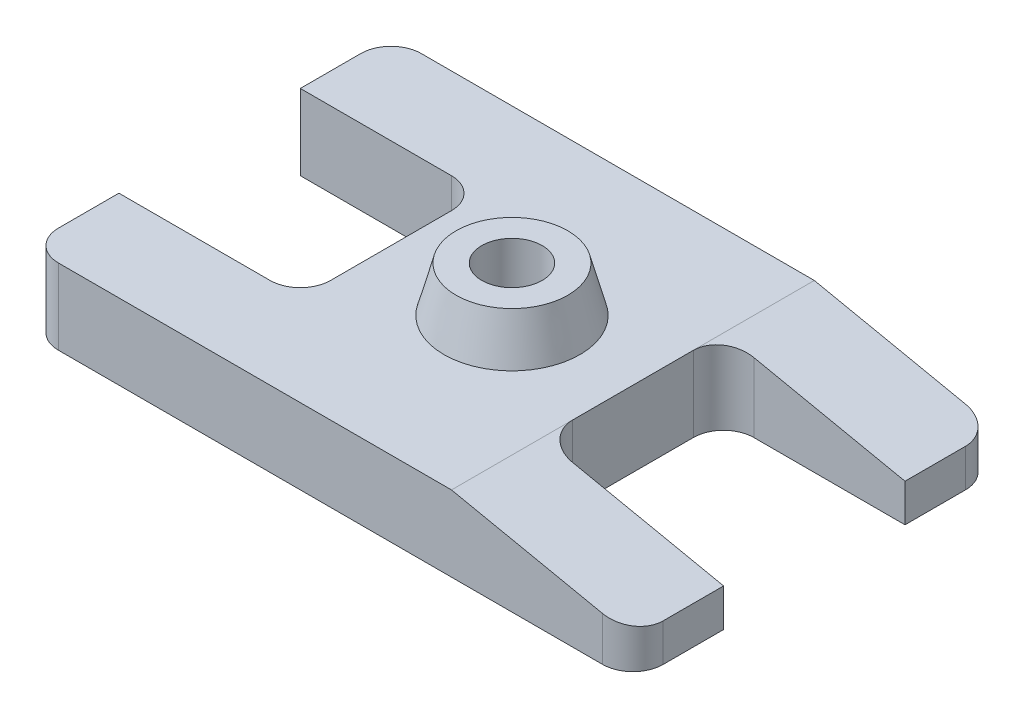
ISO-10303-21;
HEADER;
FILE_DESCRIPTION(('STEP AP214'),'2;1');
FILE_NAME('part.step','',(''),(''),'','','');
FILE_SCHEMA(('AUTOMOTIVE_DESIGN { 1 0 10303 214 1 1 1 1 }'));
ENDSEC;
DATA;
#1=APPLICATION_CONTEXT('core data for automotive mechanical design processes');
#2=APPLICATION_PROTOCOL_DEFINITION('international standard','automotive_design',2000,#1);
#3=PRODUCT_CONTEXT('',#1,'mechanical');
#4=PRODUCT('Part','Part','',(#3));
#5=PRODUCT_RELATED_PRODUCT_CATEGORY('part','',(#4));
#6=PRODUCT_DEFINITION_FORMATION('','',#4);
#7=PRODUCT_DEFINITION_CONTEXT('part definition',#1,'design');
#8=PRODUCT_DEFINITION('design','',#6,#7);
#9=PRODUCT_DEFINITION_SHAPE('','',#8);
#10=(LENGTH_UNIT() NAMED_UNIT(*) SI_UNIT(.MILLI.,.METRE.));
#11=(NAMED_UNIT(*) PLANE_ANGLE_UNIT() SI_UNIT($,.RADIAN.));
#12=(NAMED_UNIT(*) SI_UNIT($,.STERADIAN.) SOLID_ANGLE_UNIT());
#13=UNCERTAINTY_MEASURE_WITH_UNIT(LENGTH_MEASURE(1.E-05),#10,'distance_accuracy_value','');
#14=(GEOMETRIC_REPRESENTATION_CONTEXT(3) GLOBAL_UNCERTAINTY_ASSIGNED_CONTEXT((#13)) GLOBAL_UNIT_ASSIGNED_CONTEXT((#10,
#11,#12)) REPRESENTATION_CONTEXT('',''));
#15=CARTESIAN_POINT('',(0.,0.,0.));
#16=DIRECTION('',(0.,0.,1.));
#17=DIRECTION('',(1.,0.,0.));
#18=AXIS2_PLACEMENT_3D('',#15,#16,#17);
#19=CARTESIAN_POINT('',(100.,25.,60.));
#20=DIRECTION('',(-1.,0.,0.));
#21=DIRECTION('',(0.,0.,1.));
#22=AXIS2_PLACEMENT_3D('',#19,#20,#21);
#23=PLANE('',#22);
#24=DIRECTION('',(0.,0.,-1.));
#25=VECTOR('',#24,1.);
#26=CARTESIAN_POINT('',(100.,0.,60.));
#27=LINE('',#26,#25);
#28=CARTESIAN_POINT('',(100.,0.,-30.));
#29=VERTEX_POINT('',#28);
#30=CARTESIAN_POINT('',(100.,0.,-50.));
#31=VERTEX_POINT('',#30);
#32=EDGE_CURVE('E261',#29,#31,#27,.T.);
#33=ORIENTED_EDGE('',*,*,#32,.T.);
#34=DIRECTION('',(0.,-1.,0.));
#35=VECTOR('',#34,1.);
#36=CARTESIAN_POINT('',(100.,25.,-50.));
#37=LINE('',#36,#35);
#38=CARTESIAN_POINT('',(100.,12.5,-50.));
#39=VERTEX_POINT('',#38);
#40=EDGE_CURVE('E320',#31,#39,#37,.F.);
#41=ORIENTED_EDGE('',*,*,#40,.T.);
#42=DIRECTION('',(0.,0.,-1.));
#43=VECTOR('',#42,1.);
#44=CARTESIAN_POINT('',(100.,12.5,503.217602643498));
#45=LINE('',#44,#43);
#46=CARTESIAN_POINT('',(100.,12.5,-30.));
#47=VERTEX_POINT('',#46);
#48=EDGE_CURVE('E257',#47,#39,#45,.T.);
#49=ORIENTED_EDGE('',*,*,#48,.F.);
#50=DIRECTION('',(0.,-1.,0.));
#51=VECTOR('',#50,1.);
#52=CARTESIAN_POINT('',(100.,40.,-30.));
#53=LINE('',#52,#51);
#54=EDGE_CURVE('E226',#47,#29,#53,.T.);
#55=ORIENTED_EDGE('',*,*,#54,.T.);
#56=EDGE_LOOP('',(#33,#41,#49,#55));
#57=FACE_BOUND('',#56,.T.);
#58=ADVANCED_FACE('F41',(#57),#23,.F.);
#59=CARTESIAN_POINT('',(100.,12.5,50.));
#60=VERTEX_POINT('',#59);
#61=CARTESIAN_POINT('',(100.,12.5,30.));
#62=VERTEX_POINT('',#61);
#63=EDGE_CURVE('E253',#60,#62,#45,.T.);
#64=ORIENTED_EDGE('',*,*,#63,.F.);
#65=DIRECTION('',(0.,-1.,0.));
#66=VECTOR('',#65,1.);
#67=CARTESIAN_POINT('',(100.,25.,50.));
#68=LINE('',#67,#66);
#69=CARTESIAN_POINT('',(100.,0.,50.));
#70=VERTEX_POINT('',#69);
#71=EDGE_CURVE('E295',#60,#70,#68,.T.);
#72=ORIENTED_EDGE('',*,*,#71,.T.);
#73=CARTESIAN_POINT('',(100.,0.,30.));
#74=VERTEX_POINT('',#73);
#75=EDGE_CURVE('E269',#70,#74,#27,.T.);
#76=ORIENTED_EDGE('',*,*,#75,.T.);
#77=DIRECTION('',(0.,-1.,0.));
#78=VECTOR('',#77,1.);
#79=CARTESIAN_POINT('',(100.,40.,30.));
#80=LINE('',#79,#78);
#81=EDGE_CURVE('E229',#62,#74,#80,.T.);
#82=ORIENTED_EDGE('',*,*,#81,.F.);
#83=EDGE_LOOP('',(#64,#72,#76,#82));
#84=FACE_BOUND('',#83,.T.);
#85=ADVANCED_FACE('F355',(#84),#23,.F.);
#86=CARTESIAN_POINT('',(-100.,25.,60.));
#87=DIRECTION('',(1.,0.,0.));
#88=DIRECTION('',(0.,0.,-1.));
#89=AXIS2_PLACEMENT_3D('',#86,#87,#88);
#90=PLANE('',#89);
#91=DIRECTION('',(0.,0.,1.));
#92=VECTOR('',#91,1.);
#93=CARTESIAN_POINT('',(-100.,0.,60.));
#94=LINE('',#93,#92);
#95=CARTESIAN_POINT('',(-100.,0.,30.));
#96=VERTEX_POINT('',#95);
#97=CARTESIAN_POINT('',(-100.,0.,50.));
#98=VERTEX_POINT('',#97);
#99=EDGE_CURVE('E275',#96,#98,#94,.T.);
#100=ORIENTED_EDGE('',*,*,#99,.T.);
#101=DIRECTION('',(0.,-1.,0.));
#102=VECTOR('',#101,1.);
#103=CARTESIAN_POINT('',(-100.,25.,50.));
#104=LINE('',#103,#102);
#105=CARTESIAN_POINT('',(-100.,25.,50.));
#106=VERTEX_POINT('',#105);
#107=EDGE_CURVE('E193',#98,#106,#104,.F.);
#108=ORIENTED_EDGE('',*,*,#107,.T.);
#109=DIRECTION('',(0.,0.,1.));
#110=VECTOR('',#109,1.);
#111=CARTESIAN_POINT('',(-100.,25.,60.));
#112=LINE('',#111,#110);
#113=CARTESIAN_POINT('',(-100.,25.,30.));
#114=VERTEX_POINT('',#113);
#115=EDGE_CURVE('E264',#114,#106,#112,.T.);
#116=ORIENTED_EDGE('',*,*,#115,.F.);
#117=DIRECTION('',(0.,-1.,0.));
#118=VECTOR('',#117,1.);
#119=CARTESIAN_POINT('',(-100.,40.,30.));
#120=LINE('',#119,#118);
#121=EDGE_CURVE('E181',#114,#96,#120,.T.);
#122=ORIENTED_EDGE('',*,*,#121,.T.);
#123=EDGE_LOOP('',(#100,#108,#116,#122));
#124=FACE_BOUND('',#123,.T.);
#125=ADVANCED_FACE('F335',(#124),#90,.F.);
#126=CARTESIAN_POINT('',(-100.,25.,-50.));
#127=VERTEX_POINT('',#126);
#128=CARTESIAN_POINT('',(-100.,25.,-30.));
#129=VERTEX_POINT('',#128);
#130=EDGE_CURVE('E178',#127,#129,#112,.T.);
#131=ORIENTED_EDGE('',*,*,#130,.F.);
#132=DIRECTION('',(0.,-1.,0.));
#133=VECTOR('',#132,1.);
#134=CARTESIAN_POINT('',(-100.,25.,-50.));
#135=LINE('',#134,#133);
#136=CARTESIAN_POINT('',(-100.,0.,-50.));
#137=VERTEX_POINT('',#136);
#138=EDGE_CURVE('E324',#127,#137,#135,.T.);
#139=ORIENTED_EDGE('',*,*,#138,.T.);
#140=CARTESIAN_POINT('',(-100.,0.,-30.));
#141=VERTEX_POINT('',#140);
#142=EDGE_CURVE('E276',#137,#141,#94,.T.);
#143=ORIENTED_EDGE('',*,*,#142,.T.);
#144=DIRECTION('',(0.,-1.,0.));
#145=VECTOR('',#144,1.);
#146=CARTESIAN_POINT('',(-100.,40.,-30.));
#147=LINE('',#146,#145);
#148=EDGE_CURVE('E217',#129,#141,#147,.T.);
#149=ORIENTED_EDGE('',*,*,#148,.F.);
#150=EDGE_LOOP('',(#131,#139,#143,#149));
#151=FACE_BOUND('',#150,.T.);
#152=ADVANCED_FACE('F410',(#151),#90,.F.);
#153=CARTESIAN_POINT('',(0.,25.,0.));
#154=DIRECTION('',(0.,-1.,0.));
#155=DIRECTION('',(0.,0.,-1.));
#156=AXIS2_PLACEMENT_3D('',#153,#154,#155);
#157=PLANE('',#156);
#158=CARTESIAN_POINT('',(0.,25.,0.));
#159=DIRECTION('',(0.,1.,0.));
#160=DIRECTION('',(0.,0.,1.));
#161=AXIS2_PLACEMENT_3D('',#158,#159,#160);
#162=CIRCLE('',#161,22.5);
#163=CARTESIAN_POINT('',(0.,25.,22.5));
#164=VERTEX_POINT('',#163);
#165=EDGE_CURVE('E246',#164,#164,#162,.T.);
#166=ORIENTED_EDGE('',*,*,#165,.F.);
#167=EDGE_LOOP('',(#166));
#168=FACE_BOUND('',#167,.T.);
#169=DIRECTION('',(-1.,0.,0.));
#170=VECTOR('',#169,1.);
#171=CARTESIAN_POINT('',(-100.,25.,-60.));
#172=LINE('',#171,#170);
#173=CARTESIAN_POINT('',(40.,25.,-60.));
#174=VERTEX_POINT('',#173);
#175=CARTESIAN_POINT('',(-90.,25.,-60.));
#176=VERTEX_POINT('',#175);
#177=EDGE_CURVE('E262',#174,#176,#172,.T.);
#178=ORIENTED_EDGE('',*,*,#177,.T.);
#179=CARTESIAN_POINT('',(-90.,25.,-50.));
#180=DIRECTION('',(0.,-1.,0.));
#181=DIRECTION('',(0.,0.,-1.));
#182=AXIS2_PLACEMENT_3D('',#179,#180,#181);
#183=CIRCLE('',#182,10.);
#184=EDGE_CURVE('E329',#176,#127,#183,.F.);
#185=ORIENTED_EDGE('',*,*,#184,.T.);
#186=ORIENTED_EDGE('',*,*,#130,.T.);
#187=DIRECTION('',(-1.,0.,0.));
#188=VECTOR('',#187,1.);
#189=CARTESIAN_POINT('',(0.,25.,-30.));
#190=LINE('',#189,#188);
#191=CARTESIAN_POINT('',(-50.,25.,-30.));
#192=VERTEX_POINT('',#191);
#193=EDGE_CURVE('E167',#192,#129,#190,.T.);
#194=ORIENTED_EDGE('',*,*,#193,.F.);
#195=CARTESIAN_POINT('',(-50.,25.,-20.));
#196=DIRECTION('',(0.,-1.,0.));
#197=DIRECTION('',(0.,0.,-1.));
#198=AXIS2_PLACEMENT_3D('',#195,#196,#197);
#199=CIRCLE('',#198,10.);
#200=CARTESIAN_POINT('',(-40.,25.,-20.));
#201=VERTEX_POINT('',#200);
#202=EDGE_CURVE('E12',#192,#201,#199,.T.);
#203=ORIENTED_EDGE('',*,*,#202,.T.);
#204=DIRECTION('',(0.,0.,-1.));
#205=VECTOR('',#204,1.);
#206=CARTESIAN_POINT('',(-40.,25.,0.));
#207=LINE('',#206,#205);
#208=CARTESIAN_POINT('',(-40.,25.,20.));
#209=VERTEX_POINT('',#208);
#210=EDGE_CURVE('E180',#209,#201,#207,.T.);
#211=ORIENTED_EDGE('',*,*,#210,.F.);
#212=CARTESIAN_POINT('',(-50.,25.,20.));
#213=DIRECTION('',(0.,-1.,0.));
#214=DIRECTION('',(0.,0.,-1.));
#215=AXIS2_PLACEMENT_3D('',#212,#213,#214);
#216=CIRCLE('',#215,10.);
#217=CARTESIAN_POINT('',(-50.,25.,30.));
#218=VERTEX_POINT('',#217);
#219=EDGE_CURVE('E206',#209,#218,#216,.T.);
#220=ORIENTED_EDGE('',*,*,#219,.T.);
#221=DIRECTION('',(1.,0.,0.));
#222=VECTOR('',#221,1.);
#223=CARTESIAN_POINT('',(0.,25.,30.));
#224=LINE('',#223,#222);
#225=EDGE_CURVE('E242',#114,#218,#224,.T.);
#226=ORIENTED_EDGE('',*,*,#225,.F.);
#227=ORIENTED_EDGE('',*,*,#115,.T.);
#228=CARTESIAN_POINT('',(-90.,25.,50.));
#229=DIRECTION('',(0.,-1.,0.));
#230=DIRECTION('',(0.,0.,-1.));
#231=AXIS2_PLACEMENT_3D('',#228,#229,#230);
#232=CIRCLE('',#231,10.);
#233=CARTESIAN_POINT('',(-90.,25.,60.));
#234=VERTEX_POINT('',#233);
#235=EDGE_CURVE('E327',#106,#234,#232,.F.);
#236=ORIENTED_EDGE('',*,*,#235,.T.);
#237=DIRECTION('',(1.,0.,0.));
#238=VECTOR('',#237,1.);
#239=CARTESIAN_POINT('',(-100.,25.,60.));
#240=LINE('',#239,#238);
#241=CARTESIAN_POINT('',(40.,25.,60.));
#242=VERTEX_POINT('',#241);
#243=EDGE_CURVE('E267',#234,#242,#240,.T.);
#244=ORIENTED_EDGE('',*,*,#243,.T.);
#245=DIRECTION('',(0.,0.,-1.));
#246=VECTOR('',#245,1.);
#247=CARTESIAN_POINT('',(40.,25.,503.217602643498));
#248=LINE('',#247,#246);
#249=CARTESIAN_POINT('',(40.,25.,20.));
#250=VERTEX_POINT('',#249);
#251=EDGE_CURVE('E56',#242,#250,#248,.T.);
#252=ORIENTED_EDGE('',*,*,#251,.T.);
#253=CARTESIAN_POINT('',(40.,25.,-20.));
#254=VERTEX_POINT('',#253);
#255=EDGE_CURVE('E259',#250,#254,#248,.T.);
#256=ORIENTED_EDGE('',*,*,#255,.T.);
#257=EDGE_CURVE('E76',#254,#174,#248,.T.);
#258=ORIENTED_EDGE('',*,*,#257,.T.);
#259=EDGE_LOOP('',(#178,#185,#186,#194,#203,#211,#220,#226,#227,#236,#244,#252,#256,#258));
#260=FACE_BOUND('',#259,.T.);
#261=ADVANCED_FACE('F176',(#168,#260),#157,.F.);
#262=CARTESIAN_POINT('',(0.,0.,0.));
#263=DIRECTION('',(0.,-1.,0.));
#264=DIRECTION('',(0.,0.,-1.));
#265=AXIS2_PLACEMENT_3D('',#262,#263,#264);
#266=PLANE('',#265);
#267=CARTESIAN_POINT('',(0.,0.,0.));
#268=DIRECTION('',(0.,1.,0.));
#269=DIRECTION('',(0.,0.,1.));
#270=AXIS2_PLACEMENT_3D('',#267,#268,#269);
#271=CIRCLE('',#270,10.);
#272=CARTESIAN_POINT('',(0.,0.,10.));
#273=VERTEX_POINT('',#272);
#274=EDGE_CURVE('E683',#273,#273,#271,.T.);
#275=ORIENTED_EDGE('',*,*,#274,.T.);
#276=EDGE_LOOP('',(#275));
#277=FACE_BOUND('',#276,.T.);
#278=ORIENTED_EDGE('',*,*,#75,.F.);
#279=CARTESIAN_POINT('',(90.,0.,50.));
#280=DIRECTION('',(0.,-1.,0.));
#281=DIRECTION('',(0.,0.,-1.));
#282=AXIS2_PLACEMENT_3D('',#279,#280,#281);
#283=CIRCLE('',#282,10.);
#284=CARTESIAN_POINT('',(90.,0.,60.));
#285=VERTEX_POINT('',#284);
#286=EDGE_CURVE('E304',#70,#285,#283,.T.);
#287=ORIENTED_EDGE('',*,*,#286,.T.);
#288=DIRECTION('',(1.,0.,0.));
#289=VECTOR('',#288,1.);
#290=CARTESIAN_POINT('',(-100.,0.,60.));
#291=LINE('',#290,#289);
#292=CARTESIAN_POINT('',(-90.,0.,60.));
#293=VERTEX_POINT('',#292);
#294=EDGE_CURVE('E265',#293,#285,#291,.T.);
#295=ORIENTED_EDGE('',*,*,#294,.F.);
#296=CARTESIAN_POINT('',(-90.,0.,50.));
#297=DIRECTION('',(0.,-1.,0.));
#298=DIRECTION('',(0.,0.,-1.));
#299=AXIS2_PLACEMENT_3D('',#296,#297,#298);
#300=CIRCLE('',#299,10.);
#301=EDGE_CURVE('E298',#293,#98,#300,.T.);
#302=ORIENTED_EDGE('',*,*,#301,.T.);
#303=ORIENTED_EDGE('',*,*,#99,.F.);
#304=DIRECTION('',(1.,0.,0.));
#305=VECTOR('',#304,1.);
#306=CARTESIAN_POINT('',(-100.,0.,30.));
#307=LINE('',#306,#305);
#308=CARTESIAN_POINT('',(-50.,0.,30.));
#309=VERTEX_POINT('',#308);
#310=EDGE_CURVE('E215',#96,#309,#307,.T.);
#311=ORIENTED_EDGE('',*,*,#310,.T.);
#312=CARTESIAN_POINT('',(-50.,0.,20.));
#313=DIRECTION('',(0.,-1.,0.));
#314=DIRECTION('',(0.,0.,-1.));
#315=AXIS2_PLACEMENT_3D('',#312,#313,#314);
#316=CIRCLE('',#315,10.);
#317=CARTESIAN_POINT('',(-40.,0.,20.));
#318=VERTEX_POINT('',#317);
#319=EDGE_CURVE('E204',#309,#318,#316,.F.);
#320=ORIENTED_EDGE('',*,*,#319,.T.);
#321=DIRECTION('',(0.,0.,-1.));
#322=VECTOR('',#321,1.);
#323=CARTESIAN_POINT('',(-40.,0.,-30.));
#324=LINE('',#323,#322);
#325=CARTESIAN_POINT('',(-40.,0.,-20.));
#326=VERTEX_POINT('',#325);
#327=EDGE_CURVE('E212',#318,#326,#324,.T.);
#328=ORIENTED_EDGE('',*,*,#327,.T.);
#329=CARTESIAN_POINT('',(-50.,0.,-20.));
#330=DIRECTION('',(0.,-1.,0.));
#331=DIRECTION('',(0.,0.,-1.));
#332=AXIS2_PLACEMENT_3D('',#329,#330,#331);
#333=CIRCLE('',#332,10.);
#334=CARTESIAN_POINT('',(-50.,0.,-30.));
#335=VERTEX_POINT('',#334);
#336=EDGE_CURVE('E49',#326,#335,#333,.F.);
#337=ORIENTED_EDGE('',*,*,#336,.T.);
#338=DIRECTION('',(-1.,0.,0.));
#339=VECTOR('',#338,1.);
#340=CARTESIAN_POINT('',(-100.,0.,-30.));
#341=LINE('',#340,#339);
#342=EDGE_CURVE('E170',#335,#141,#341,.T.);
#343=ORIENTED_EDGE('',*,*,#342,.T.);
#344=ORIENTED_EDGE('',*,*,#142,.F.);
#345=CARTESIAN_POINT('',(-90.,0.,-50.));
#346=DIRECTION('',(0.,-1.,0.));
#347=DIRECTION('',(0.,0.,-1.));
#348=AXIS2_PLACEMENT_3D('',#345,#346,#347);
#349=CIRCLE('',#348,10.);
#350=CARTESIAN_POINT('',(-90.,0.,-60.));
#351=VERTEX_POINT('',#350);
#352=EDGE_CURVE('E300',#137,#351,#349,.T.);
#353=ORIENTED_EDGE('',*,*,#352,.T.);
#354=DIRECTION('',(-1.,0.,0.));
#355=VECTOR('',#354,1.);
#356=CARTESIAN_POINT('',(-100.,0.,-60.));
#357=LINE('',#356,#355);
#358=CARTESIAN_POINT('',(90.,0.,-60.));
#359=VERTEX_POINT('',#358);
#360=EDGE_CURVE('E272',#359,#351,#357,.T.);
#361=ORIENTED_EDGE('',*,*,#360,.F.);
#362=CARTESIAN_POINT('',(90.,0.,-50.));
#363=DIRECTION('',(0.,-1.,0.));
#364=DIRECTION('',(0.,0.,-1.));
#365=AXIS2_PLACEMENT_3D('',#362,#363,#364);
#366=CIRCLE('',#365,10.);
#367=EDGE_CURVE('E302',#359,#31,#366,.T.);
#368=ORIENTED_EDGE('',*,*,#367,.T.);
#369=ORIENTED_EDGE('',*,*,#32,.F.);
#370=DIRECTION('',(-1.,0.,0.));
#371=VECTOR('',#370,1.);
#372=CARTESIAN_POINT('',(100.,0.,-30.));
#373=LINE('',#372,#371);
#374=CARTESIAN_POINT('',(50.,0.,-30.));
#375=VERTEX_POINT('',#374);
#376=EDGE_CURVE('E219',#29,#375,#373,.T.);
#377=ORIENTED_EDGE('',*,*,#376,.T.);
#378=CARTESIAN_POINT('',(50.,0.,-20.));
#379=DIRECTION('',(0.,-1.,0.));
#380=DIRECTION('',(0.,0.,-1.));
#381=AXIS2_PLACEMENT_3D('',#378,#379,#380);
#382=CIRCLE('',#381,10.);
#383=CARTESIAN_POINT('',(40.,0.,-20.));
#384=VERTEX_POINT('',#383);
#385=EDGE_CURVE('E172',#375,#384,#382,.F.);
#386=ORIENTED_EDGE('',*,*,#385,.T.);
#387=DIRECTION('',(0.,0.,1.));
#388=VECTOR('',#387,1.);
#389=CARTESIAN_POINT('',(40.,0.,-30.));
#390=LINE('',#389,#388);
#391=CARTESIAN_POINT('',(40.,0.,20.));
#392=VERTEX_POINT('',#391);
#393=EDGE_CURVE('E236',#384,#392,#390,.T.);
#394=ORIENTED_EDGE('',*,*,#393,.T.);
#395=CARTESIAN_POINT('',(50.,0.,20.));
#396=DIRECTION('',(0.,-1.,0.));
#397=DIRECTION('',(0.,0.,-1.));
#398=AXIS2_PLACEMENT_3D('',#395,#396,#397);
#399=CIRCLE('',#398,10.);
#400=CARTESIAN_POINT('',(50.,0.,30.));
#401=VERTEX_POINT('',#400);
#402=EDGE_CURVE('E88',#392,#401,#399,.F.);
#403=ORIENTED_EDGE('',*,*,#402,.T.);
#404=DIRECTION('',(1.,0.,0.));
#405=VECTOR('',#404,1.);
#406=CARTESIAN_POINT('',(100.,0.,30.));
#407=LINE('',#406,#405);
#408=EDGE_CURVE('E233',#401,#74,#407,.T.);
#409=ORIENTED_EDGE('',*,*,#408,.T.);
#410=EDGE_LOOP('',(#278,#287,#295,#302,#303,#311,#320,#328,#337,#343,#344,#353,#361,#368,#369,
#377,#386,#394,#403,#409));
#411=FACE_BOUND('',#410,.T.);
#412=ADVANCED_FACE('F209',(#277,#411),#266,.T.);
#413=CARTESIAN_POINT('',(40.,25.,503.217602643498));
#414=DIRECTION('',(0.203954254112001,0.978980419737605,0.));
#415=DIRECTION('',(-0.978980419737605,0.203954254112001,0.));
#416=AXIS2_PLACEMENT_3D('',#413,#414,#415);
#417=PLANE('',#416);
#418=ORIENTED_EDGE('',*,*,#48,.T.);
#419=CARTESIAN_POINT('',(90.,14.5833333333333,-50.));
#420=DIRECTION('',(0.203954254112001,0.978980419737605,0.));
#421=DIRECTION('',(0.978980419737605,-0.203954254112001,0.));
#422=AXIS2_PLACEMENT_3D('',#419,#420,#421);
#423=ELLIPSE('',#422,10.2147088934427,10.);
#424=CARTESIAN_POINT('',(90.,14.5833333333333,-60.));
#425=VERTEX_POINT('',#424);
#426=EDGE_CURVE('E322',#39,#425,#423,.T.);
#427=ORIENTED_EDGE('',*,*,#426,.T.);
#428=DIRECTION('',(-0.978980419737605,0.203954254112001,0.));
#429=VECTOR('',#428,1.);
#430=CARTESIAN_POINT('',(-94.1763727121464,52.9534109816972,-60.));
#431=LINE('',#430,#429);
#432=EDGE_CURVE('E256',#425,#174,#431,.T.);
#433=ORIENTED_EDGE('',*,*,#432,.T.);
#434=ORIENTED_EDGE('',*,*,#257,.F.);
#435=CARTESIAN_POINT('',(50.,22.9166666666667,-20.));
#436=DIRECTION('',(0.203954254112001,0.978980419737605,0.));
#437=DIRECTION('',(-0.978980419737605,0.203954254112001,0.));
#438=AXIS2_PLACEMENT_3D('',#435,#436,#437);
#439=ELLIPSE('',#438,10.2147088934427,10.);
#440=CARTESIAN_POINT('',(50.,22.9166666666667,-30.));
#441=VERTEX_POINT('',#440);
#442=EDGE_CURVE('E198',#254,#441,#439,.F.);
#443=ORIENTED_EDGE('',*,*,#442,.T.);
#444=DIRECTION('',(0.978980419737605,-0.203954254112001,0.));
#445=VECTOR('',#444,1.);
#446=CARTESIAN_POINT('',(39.9999999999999,25.,-30.));
#447=LINE('',#446,#445);
#448=EDGE_CURVE('E285',#441,#47,#447,.T.);
#449=ORIENTED_EDGE('',*,*,#448,.T.);
#450=EDGE_LOOP('',(#418,#427,#433,#434,#443,#449));
#451=FACE_BOUND('',#450,.T.);
#452=ADVANCED_FACE('F384',(#451),#417,.T.);
#453=DIRECTION('',(0.978980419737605,-0.203954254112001,0.));
#454=VECTOR('',#453,1.);
#455=CARTESIAN_POINT('',(-94.1763727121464,52.9534109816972,60.));
#456=LINE('',#455,#454);
#457=CARTESIAN_POINT('',(90.,14.5833333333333,60.));
#458=VERTEX_POINT('',#457);
#459=EDGE_CURVE('E250',#242,#458,#456,.T.);
#460=ORIENTED_EDGE('',*,*,#459,.T.);
#461=CARTESIAN_POINT('',(90.,14.5833333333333,50.));
#462=DIRECTION('',(0.203954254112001,0.978980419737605,0.));
#463=DIRECTION('',(0.978980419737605,-0.203954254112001,0.));
#464=AXIS2_PLACEMENT_3D('',#461,#462,#463);
#465=ELLIPSE('',#464,10.2147088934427,10.);
#466=EDGE_CURVE('E311',#458,#60,#465,.T.);
#467=ORIENTED_EDGE('',*,*,#466,.T.);
#468=ORIENTED_EDGE('',*,*,#63,.T.);
#469=DIRECTION('',(-0.978980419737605,0.203954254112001,0.));
#470=VECTOR('',#469,1.);
#471=CARTESIAN_POINT('',(40.,25.,30.));
#472=LINE('',#471,#470);
#473=CARTESIAN_POINT('',(50.,22.9166666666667,30.));
#474=VERTEX_POINT('',#473);
#475=EDGE_CURVE('E249',#62,#474,#472,.T.);
#476=ORIENTED_EDGE('',*,*,#475,.T.);
#477=CARTESIAN_POINT('',(50.,22.9166666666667,20.));
#478=DIRECTION('',(0.203954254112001,0.978980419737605,0.));
#479=DIRECTION('',(-0.978980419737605,0.203954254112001,0.));
#480=AXIS2_PLACEMENT_3D('',#477,#478,#479);
#481=ELLIPSE('',#480,10.2147088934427,10.);
#482=EDGE_CURVE('E201',#474,#250,#481,.F.);
#483=ORIENTED_EDGE('',*,*,#482,.T.);
#484=ORIENTED_EDGE('',*,*,#251,.F.);
#485=EDGE_LOOP('',(#460,#467,#468,#476,#483,#484));
#486=FACE_BOUND('',#485,.T.);
#487=ADVANCED_FACE('F361',(#486),#417,.T.);
#488=CARTESIAN_POINT('',(-100.,25.,-60.));
#489=DIRECTION('',(0.,0.,1.));
#490=DIRECTION('',(1.,0.,0.));
#491=AXIS2_PLACEMENT_3D('',#488,#489,#490);
#492=PLANE('',#491);
#493=ORIENTED_EDGE('',*,*,#432,.F.);
#494=DIRECTION('',(0.,-1.,0.));
#495=VECTOR('',#494,1.);
#496=CARTESIAN_POINT('',(90.,25.,-60.));
#497=LINE('',#496,#495);
#498=EDGE_CURVE('E317',#425,#359,#497,.T.);
#499=ORIENTED_EDGE('',*,*,#498,.T.);
#500=ORIENTED_EDGE('',*,*,#360,.T.);
#501=DIRECTION('',(0.,-1.,0.));
#502=VECTOR('',#501,1.);
#503=CARTESIAN_POINT('',(-90.,25.,-60.));
#504=LINE('',#503,#502);
#505=EDGE_CURVE('E315',#351,#176,#504,.F.);
#506=ORIENTED_EDGE('',*,*,#505,.T.);
#507=ORIENTED_EDGE('',*,*,#177,.F.);
#508=EDGE_LOOP('',(#493,#499,#500,#506,#507));
#509=FACE_BOUND('',#508,.T.);
#510=ADVANCED_FACE('F402',(#509),#492,.F.);
#511=CARTESIAN_POINT('',(-100.,25.,60.));
#512=DIRECTION('',(0.,0.,-1.));
#513=DIRECTION('',(-1.,0.,0.));
#514=AXIS2_PLACEMENT_3D('',#511,#512,#513);
#515=PLANE('',#514);
#516=ORIENTED_EDGE('',*,*,#294,.T.);
#517=DIRECTION('',(0.,-1.,0.));
#518=VECTOR('',#517,1.);
#519=CARTESIAN_POINT('',(90.,25.,60.));
#520=LINE('',#519,#518);
#521=EDGE_CURVE('E309',#285,#458,#520,.F.);
#522=ORIENTED_EDGE('',*,*,#521,.T.);
#523=ORIENTED_EDGE('',*,*,#459,.F.);
#524=ORIENTED_EDGE('',*,*,#243,.F.);
#525=DIRECTION('',(0.,-1.,0.));
#526=VECTOR('',#525,1.);
#527=CARTESIAN_POINT('',(-90.,25.,60.));
#528=LINE('',#527,#526);
#529=EDGE_CURVE('E306',#234,#293,#528,.T.);
#530=ORIENTED_EDGE('',*,*,#529,.T.);
#531=EDGE_LOOP('',(#516,#522,#523,#524,#530));
#532=FACE_BOUND('',#531,.T.);
#533=ADVANCED_FACE('F346',(#532),#515,.F.);
#534=CARTESIAN_POINT('',(0.,25.,0.));
#535=DIRECTION('',(0.,-1.,0.));
#536=DIRECTION('',(0.,0.,1.));
#537=AXIS2_PLACEMENT_3D('',#534,#535,#536);
#538=CONICAL_SURFACE('',#537,22.5,0.26179938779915);
#539=CARTESIAN_POINT('',(0.,40.,0.));
#540=DIRECTION('',(0.,-1.,0.));
#541=DIRECTION('',(0.,0.,-1.));
#542=AXIS2_PLACEMENT_3D('',#539,#540,#541);
#543=CIRCLE('',#542,18.4807621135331);
#544=CARTESIAN_POINT('',(0.,40.,-18.4807621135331));
#545=VERTEX_POINT('',#544);
#546=EDGE_CURVE('E245',#545,#545,#543,.T.);
#547=ORIENTED_EDGE('',*,*,#546,.T.);
#548=EDGE_LOOP('',(#547));
#549=FACE_BOUND('',#548,.T.);
#550=ORIENTED_EDGE('',*,*,#165,.T.);
#551=EDGE_LOOP('',(#550));
#552=FACE_BOUND('',#551,.T.);
#553=ADVANCED_FACE('F570',(#549,#552),#538,.T.);
#554=CARTESIAN_POINT('',(0.,40.,0.));
#555=DIRECTION('',(0.,-1.,0.));
#556=DIRECTION('',(0.,0.,-1.));
#557=AXIS2_PLACEMENT_3D('',#554,#555,#556);
#558=PLANE('',#557);
#559=CARTESIAN_POINT('',(0.,40.,0.));
#560=DIRECTION('',(0.,1.,0.));
#561=DIRECTION('',(0.,0.,1.));
#562=AXIS2_PLACEMENT_3D('',#559,#560,#561);
#563=CIRCLE('',#562,10.);
#564=CARTESIAN_POINT('',(0.,40.,10.));
#565=VERTEX_POINT('',#564);
#566=EDGE_CURVE('E230',#565,#565,#563,.T.);
#567=ORIENTED_EDGE('',*,*,#566,.F.);
#568=EDGE_LOOP('',(#567));
#569=FACE_BOUND('',#568,.T.);
#570=ORIENTED_EDGE('',*,*,#546,.F.);
#571=EDGE_LOOP('',(#570));
#572=FACE_BOUND('',#571,.T.);
#573=ADVANCED_FACE('F558',(#569,#572),#558,.F.);
#574=CARTESIAN_POINT('',(100.,40.,-30.));
#575=DIRECTION('',(0.,0.,1.));
#576=DIRECTION('',(1.,0.,0.));
#577=AXIS2_PLACEMENT_3D('',#574,#575,#576);
#578=PLANE('',#577);
#579=ORIENTED_EDGE('',*,*,#448,.F.);
#580=DIRECTION('',(0.,-1.,0.));
#581=VECTOR('',#580,1.);
#582=CARTESIAN_POINT('',(50.,0.,-30.));
#583=LINE('',#582,#581);
#584=EDGE_CURVE('E288',#441,#375,#583,.T.);
#585=ORIENTED_EDGE('',*,*,#584,.T.);
#586=ORIENTED_EDGE('',*,*,#376,.F.);
#587=ORIENTED_EDGE('',*,*,#54,.F.);
#588=EDGE_LOOP('',(#579,#585,#586,#587));
#589=FACE_BOUND('',#588,.T.);
#590=ADVANCED_FACE('F390',(#589),#578,.T.);
#591=CARTESIAN_POINT('',(40.,40.,-30.));
#592=DIRECTION('',(1.,0.,0.));
#593=DIRECTION('',(0.,0.,-1.));
#594=AXIS2_PLACEMENT_3D('',#591,#592,#593);
#595=PLANE('',#594);
#596=ORIENTED_EDGE('',*,*,#393,.F.);
#597=DIRECTION('',(0.,-1.,0.));
#598=VECTOR('',#597,1.);
#599=CARTESIAN_POINT('',(40.,25.,-20.));
#600=LINE('',#599,#598);
#601=EDGE_CURVE('E293',#384,#254,#600,.F.);
#602=ORIENTED_EDGE('',*,*,#601,.T.);
#603=ORIENTED_EDGE('',*,*,#255,.F.);
#604=DIRECTION('',(0.,-1.,0.));
#605=VECTOR('',#604,1.);
#606=CARTESIAN_POINT('',(40.,0.,20.));
#607=LINE('',#606,#605);
#608=EDGE_CURVE('E291',#250,#392,#607,.T.);
#609=ORIENTED_EDGE('',*,*,#608,.T.);
#610=EDGE_LOOP('',(#596,#602,#603,#609));
#611=FACE_BOUND('',#610,.T.);
#612=ADVANCED_FACE('F397',(#611),#595,.T.);
#613=CARTESIAN_POINT('',(100.,40.,30.));
#614=DIRECTION('',(0.,0.,-1.));
#615=DIRECTION('',(-1.,0.,0.));
#616=AXIS2_PLACEMENT_3D('',#613,#614,#615);
#617=PLANE('',#616);
#618=ORIENTED_EDGE('',*,*,#408,.F.);
#619=DIRECTION('',(0.,-1.,0.));
#620=VECTOR('',#619,1.);
#621=CARTESIAN_POINT('',(50.,25.,30.));
#622=LINE('',#621,#620);
#623=EDGE_CURVE('E313',#401,#474,#622,.F.);
#624=ORIENTED_EDGE('',*,*,#623,.T.);
#625=ORIENTED_EDGE('',*,*,#475,.F.);
#626=ORIENTED_EDGE('',*,*,#81,.T.);
#627=EDGE_LOOP('',(#618,#624,#625,#626));
#628=FACE_BOUND('',#627,.T.);
#629=ADVANCED_FACE('F368',(#628),#617,.T.);
#630=CARTESIAN_POINT('',(-100.,40.,30.));
#631=DIRECTION('',(0.,0.,-1.));
#632=DIRECTION('',(-1.,0.,0.));
#633=AXIS2_PLACEMENT_3D('',#630,#631,#632);
#634=PLANE('',#633);
#635=ORIENTED_EDGE('',*,*,#225,.T.);
#636=DIRECTION('',(0.,-1.,0.));
#637=VECTOR('',#636,1.);
#638=CARTESIAN_POINT('',(-50.,0.,30.));
#639=LINE('',#638,#637);
#640=EDGE_CURVE('E189',#218,#309,#639,.T.);
#641=ORIENTED_EDGE('',*,*,#640,.T.);
#642=ORIENTED_EDGE('',*,*,#310,.F.);
#643=ORIENTED_EDGE('',*,*,#121,.F.);
#644=EDGE_LOOP('',(#635,#641,#642,#643));
#645=FACE_BOUND('',#644,.T.);
#646=ADVANCED_FACE('F418',(#645),#634,.T.);
#647=CARTESIAN_POINT('',(-40.,40.,-30.));
#648=DIRECTION('',(-1.,0.,0.));
#649=DIRECTION('',(0.,0.,1.));
#650=AXIS2_PLACEMENT_3D('',#647,#648,#649);
#651=PLANE('',#650);
#652=ORIENTED_EDGE('',*,*,#327,.F.);
#653=DIRECTION('',(0.,-1.,0.));
#654=VECTOR('',#653,1.);
#655=CARTESIAN_POINT('',(-40.,25.,20.));
#656=LINE('',#655,#654);
#657=EDGE_CURVE('E173',#318,#209,#656,.F.);
#658=ORIENTED_EDGE('',*,*,#657,.T.);
#659=ORIENTED_EDGE('',*,*,#210,.T.);
#660=DIRECTION('',(0.,-1.,0.));
#661=VECTOR('',#660,1.);
#662=CARTESIAN_POINT('',(-40.,0.,-20.));
#663=LINE('',#662,#661);
#664=EDGE_CURVE('E185',#201,#326,#663,.T.);
#665=ORIENTED_EDGE('',*,*,#664,.T.);
#666=EDGE_LOOP('',(#652,#658,#659,#665));
#667=FACE_BOUND('',#666,.T.);
#668=ADVANCED_FACE('F423',(#667),#651,.T.);
#669=CARTESIAN_POINT('',(-100.,40.,-30.));
#670=DIRECTION('',(0.,0.,1.));
#671=DIRECTION('',(1.,0.,0.));
#672=AXIS2_PLACEMENT_3D('',#669,#670,#671);
#673=PLANE('',#672);
#674=ORIENTED_EDGE('',*,*,#342,.F.);
#675=DIRECTION('',(0.,-1.,0.));
#676=VECTOR('',#675,1.);
#677=CARTESIAN_POINT('',(-50.,25.,-30.));
#678=LINE('',#677,#676);
#679=EDGE_CURVE('E163',#335,#192,#678,.F.);
#680=ORIENTED_EDGE('',*,*,#679,.T.);
#681=ORIENTED_EDGE('',*,*,#193,.T.);
#682=ORIENTED_EDGE('',*,*,#148,.T.);
#683=EDGE_LOOP('',(#674,#680,#681,#682));
#684=FACE_BOUND('',#683,.T.);
#685=ADVANCED_FACE('F164',(#684),#673,.T.);
#686=CARTESIAN_POINT('',(0.,40.,0.));
#687=DIRECTION('',(0.,-1.,0.));
#688=DIRECTION('',(0.,0.,-1.));
#689=AXIS2_PLACEMENT_3D('',#686,#687,#688);
#690=CYLINDRICAL_SURFACE('',#689,10.);
#691=ORIENTED_EDGE('',*,*,#566,.T.);
#692=EDGE_LOOP('',(#691));
#693=FACE_BOUND('',#692,.T.);
#694=ORIENTED_EDGE('',*,*,#274,.F.);
#695=EDGE_LOOP('',(#694));
#696=FACE_BOUND('',#695,.T.);
#697=ADVANCED_FACE('F430',(#693,#696),#690,.F.);
#698=CARTESIAN_POINT('',(50.,40.,-20.));
#699=DIRECTION('',(0.,1.,0.));
#700=DIRECTION('',(0.,0.,1.));
#701=AXIS2_PLACEMENT_3D('',#698,#699,#700);
#702=CYLINDRICAL_SURFACE('',#701,10.);
#703=ORIENTED_EDGE('',*,*,#442,.F.);
#704=ORIENTED_EDGE('',*,*,#601,.F.);
#705=ORIENTED_EDGE('',*,*,#385,.F.);
#706=ORIENTED_EDGE('',*,*,#584,.F.);
#707=EDGE_LOOP('',(#703,#704,#705,#706));
#708=FACE_BOUND('',#707,.T.);
#709=ADVANCED_FACE('F393',(#708),#702,.F.);
#710=CARTESIAN_POINT('',(90.,25.,50.));
#711=DIRECTION('',(0.,-1.,0.));
#712=DIRECTION('',(0.,0.,-1.));
#713=AXIS2_PLACEMENT_3D('',#710,#711,#712);
#714=CYLINDRICAL_SURFACE('',#713,10.);
#715=ORIENTED_EDGE('',*,*,#466,.F.);
#716=ORIENTED_EDGE('',*,*,#521,.F.);
#717=ORIENTED_EDGE('',*,*,#286,.F.);
#718=ORIENTED_EDGE('',*,*,#71,.F.);
#719=EDGE_LOOP('',(#715,#716,#717,#718));
#720=FACE_BOUND('',#719,.T.);
#721=ADVANCED_FACE('F352',(#720),#714,.T.);
#722=CARTESIAN_POINT('',(50.,40.,20.));
#723=DIRECTION('',(0.,1.,0.));
#724=DIRECTION('',(0.,0.,1.));
#725=AXIS2_PLACEMENT_3D('',#722,#723,#724);
#726=CYLINDRICAL_SURFACE('',#725,10.);
#727=ORIENTED_EDGE('',*,*,#482,.F.);
#728=ORIENTED_EDGE('',*,*,#623,.F.);
#729=ORIENTED_EDGE('',*,*,#402,.F.);
#730=ORIENTED_EDGE('',*,*,#608,.F.);
#731=EDGE_LOOP('',(#727,#728,#729,#730));
#732=FACE_BOUND('',#731,.T.);
#733=ADVANCED_FACE('F369',(#732),#726,.F.);
#734=CARTESIAN_POINT('',(90.,25.,-50.));
#735=DIRECTION('',(0.,-1.,0.));
#736=DIRECTION('',(0.,0.,-1.));
#737=AXIS2_PLACEMENT_3D('',#734,#735,#736);
#738=CYLINDRICAL_SURFACE('',#737,10.);
#739=ORIENTED_EDGE('',*,*,#426,.F.);
#740=ORIENTED_EDGE('',*,*,#40,.F.);
#741=ORIENTED_EDGE('',*,*,#367,.F.);
#742=ORIENTED_EDGE('',*,*,#498,.F.);
#743=EDGE_LOOP('',(#739,#740,#741,#742));
#744=FACE_BOUND('',#743,.T.);
#745=ADVANCED_FACE('F449',(#744),#738,.T.);
#746=CARTESIAN_POINT('',(-90.,25.,-50.));
#747=DIRECTION('',(0.,-1.,0.));
#748=DIRECTION('',(0.,0.,-1.));
#749=AXIS2_PLACEMENT_3D('',#746,#747,#748);
#750=CYLINDRICAL_SURFACE('',#749,10.);
#751=ORIENTED_EDGE('',*,*,#184,.F.);
#752=ORIENTED_EDGE('',*,*,#505,.F.);
#753=ORIENTED_EDGE('',*,*,#352,.F.);
#754=ORIENTED_EDGE('',*,*,#138,.F.);
#755=EDGE_LOOP('',(#751,#752,#753,#754));
#756=FACE_BOUND('',#755,.T.);
#757=ADVANCED_FACE('F407',(#756),#750,.T.);
#758=CARTESIAN_POINT('',(-90.,25.,50.));
#759=DIRECTION('',(0.,-1.,0.));
#760=DIRECTION('',(0.,0.,-1.));
#761=AXIS2_PLACEMENT_3D('',#758,#759,#760);
#762=CYLINDRICAL_SURFACE('',#761,10.);
#763=ORIENTED_EDGE('',*,*,#235,.F.);
#764=ORIENTED_EDGE('',*,*,#107,.F.);
#765=ORIENTED_EDGE('',*,*,#301,.F.);
#766=ORIENTED_EDGE('',*,*,#529,.F.);
#767=EDGE_LOOP('',(#763,#764,#765,#766));
#768=FACE_BOUND('',#767,.T.);
#769=ADVANCED_FACE('F343',(#768),#762,.T.);
#770=CARTESIAN_POINT('',(-50.,40.,20.));
#771=DIRECTION('',(0.,1.,0.));
#772=DIRECTION('',(0.,0.,1.));
#773=AXIS2_PLACEMENT_3D('',#770,#771,#772);
#774=CYLINDRICAL_SURFACE('',#773,10.);
#775=ORIENTED_EDGE('',*,*,#219,.F.);
#776=ORIENTED_EDGE('',*,*,#657,.F.);
#777=ORIENTED_EDGE('',*,*,#319,.F.);
#778=ORIENTED_EDGE('',*,*,#640,.F.);
#779=EDGE_LOOP('',(#775,#776,#777,#778));
#780=FACE_BOUND('',#779,.T.);
#781=ADVANCED_FACE('F422',(#780),#774,.F.);
#782=CARTESIAN_POINT('',(-50.,40.,-20.));
#783=DIRECTION('',(0.,1.,0.));
#784=DIRECTION('',(0.,0.,1.));
#785=AXIS2_PLACEMENT_3D('',#782,#783,#784);
#786=CYLINDRICAL_SURFACE('',#785,10.);
#787=ORIENTED_EDGE('',*,*,#202,.F.);
#788=ORIENTED_EDGE('',*,*,#679,.F.);
#789=ORIENTED_EDGE('',*,*,#336,.F.);
#790=ORIENTED_EDGE('',*,*,#664,.F.);
#791=EDGE_LOOP('',(#787,#788,#789,#790));
#792=FACE_BOUND('',#791,.T.);
#793=ADVANCED_FACE('F43',(#792),#786,.F.);
#794=CLOSED_SHELL('',(#58,#85,#125,#152,#261,#412,#452,#487,#510,#533,#553,#573,#590,#612,#629,
#646,#668,#685,#697,#709,#721,#733,#745,#757,#769,#781,#793));
#795=MANIFOLD_SOLID_BREP('B2',#794);
#796=ADVANCED_BREP_SHAPE_REPRESENTATION('',(#18,#795),#14);
#797=SHAPE_DEFINITION_REPRESENTATION(#9,#796);
ENDSEC;
END-ISO-10303-21;
